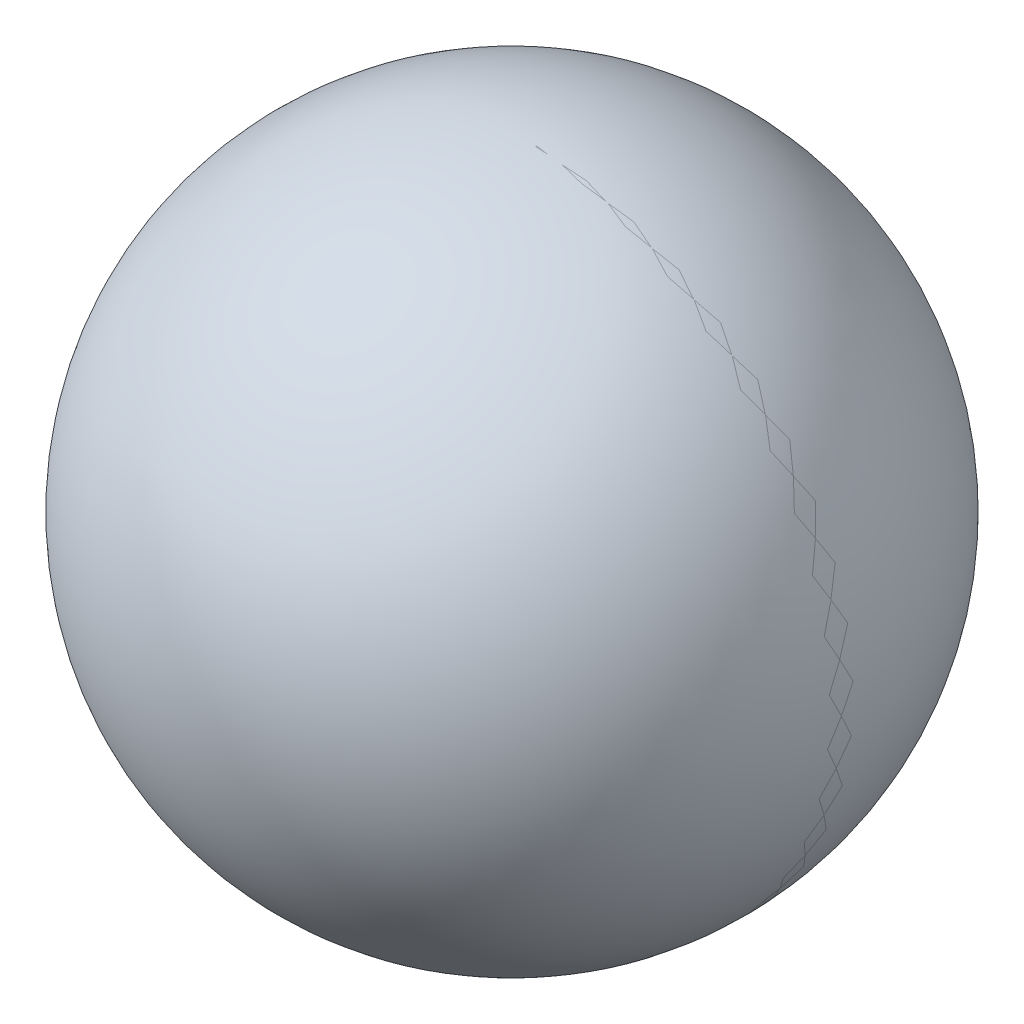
ISO-10303-21;
HEADER;
FILE_DESCRIPTION(('STEP AP214'),'2;1');
FILE_NAME('part.step','',(''),(''),'','','');
FILE_SCHEMA(('AUTOMOTIVE_DESIGN { 1 0 10303 214 1 1 1 1 }'));
ENDSEC;
DATA;
#1=APPLICATION_CONTEXT('core data for automotive mechanical design processes');
#2=APPLICATION_PROTOCOL_DEFINITION('international standard','automotive_design',2000,#1);
#3=PRODUCT_CONTEXT('',#1,'mechanical');
#4=PRODUCT('Part','Part','',(#3));
#5=PRODUCT_RELATED_PRODUCT_CATEGORY('part','',(#4));
#6=PRODUCT_DEFINITION_FORMATION('','',#4);
#7=PRODUCT_DEFINITION_CONTEXT('part definition',#1,'design');
#8=PRODUCT_DEFINITION('design','',#6,#7);
#9=PRODUCT_DEFINITION_SHAPE('','',#8);
#10=(LENGTH_UNIT() NAMED_UNIT(*) SI_UNIT(.MILLI.,.METRE.));
#11=(NAMED_UNIT(*) PLANE_ANGLE_UNIT() SI_UNIT($,.RADIAN.));
#12=(NAMED_UNIT(*) SI_UNIT($,.STERADIAN.) SOLID_ANGLE_UNIT());
#13=UNCERTAINTY_MEASURE_WITH_UNIT(LENGTH_MEASURE(1.E-05),#10,'distance_accuracy_value','');
#14=(GEOMETRIC_REPRESENTATION_CONTEXT(3) GLOBAL_UNCERTAINTY_ASSIGNED_CONTEXT((#13)) GLOBAL_UNIT_ASSIGNED_CONTEXT((#10,
#11,#12)) REPRESENTATION_CONTEXT('',''));
#15=CARTESIAN_POINT('',(0.,0.,0.));
#16=DIRECTION('',(0.,0.,1.));
#17=DIRECTION('',(1.,0.,0.));
#18=AXIS2_PLACEMENT_3D('',#15,#16,#17);
#19=CARTESIAN_POINT('',(0.,40.,0.));
#20=DIRECTION('',(0.,-1.,0.));
#21=DIRECTION('',(-1.,0.,0.));
#22=AXIS2_PLACEMENT_3D('',#19,#20,#21);
#23=SPHERICAL_SURFACE('',#22,40.);
#24=CARTESIAN_POINT('',(0.,0.,0.));
#25=VERTEX_POINT('',#24);
#26=VERTEX_LOOP('',#25);
#27=FACE_BOUND('',#26,.T.);
#28=ADVANCED_FACE('F34',(#27),#23,.T.);
#29=CLOSED_SHELL('',(#28));
#30=CARTESIAN_POINT('',(0.,40.,0.));
#31=DIRECTION('',(0.,-1.,0.));
#32=DIRECTION('',(1.,0.,0.));
#33=AXIS2_PLACEMENT_3D('',#30,#31,#32);
#34=SPHERICAL_SURFACE('',#33,39.9999);
#35=CARTESIAN_POINT('',(0.,0.000100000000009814,0.));
#36=VERTEX_POINT('',#35);
#37=VERTEX_LOOP('',#36);
#38=FACE_BOUND('',#37,.T.);
#39=ADVANCED_FACE('F46',(#38),#34,.F.);
#40=CLOSED_SHELL('',(#39));
#41=ORIENTED_CLOSED_SHELL('',*,#40,.T.);
#42=BREP_WITH_VOIDS('B2',#29,(#41));
#43=ADVANCED_BREP_SHAPE_REPRESENTATION('',(#18,#42),#14);
#44=SHAPE_DEFINITION_REPRESENTATION(#9,#43);
ENDSEC;
END-ISO-10303-21;
